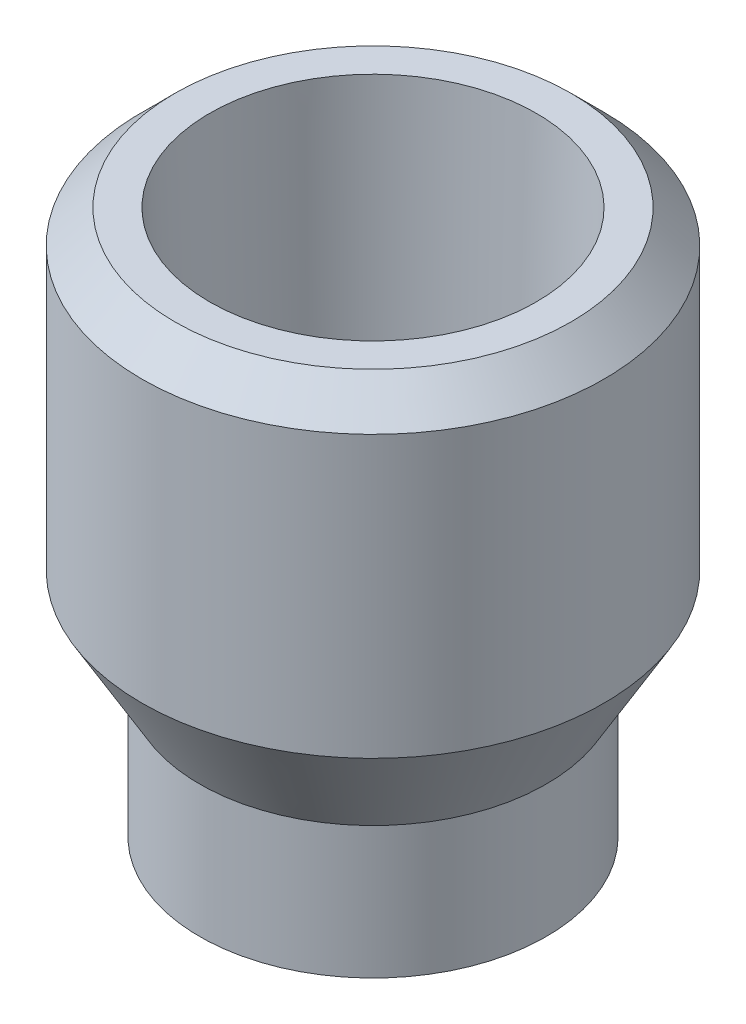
ISO-10303-21;
HEADER;
FILE_DESCRIPTION(('STEP AP214'),'2;1');
FILE_NAME('part.step','',(''),(''),'','','');
FILE_SCHEMA(('AUTOMOTIVE_DESIGN { 1 0 10303 214 1 1 1 1 }'));
ENDSEC;
DATA;
#1=APPLICATION_CONTEXT('core data for automotive mechanical design processes');
#2=APPLICATION_PROTOCOL_DEFINITION('international standard','automotive_design',2000,#1);
#3=PRODUCT_CONTEXT('',#1,'mechanical');
#4=PRODUCT('Part','Part','',(#3));
#5=PRODUCT_RELATED_PRODUCT_CATEGORY('part','',(#4));
#6=PRODUCT_DEFINITION_FORMATION('','',#4);
#7=PRODUCT_DEFINITION_CONTEXT('part definition',#1,'design');
#8=PRODUCT_DEFINITION('design','',#6,#7);
#9=PRODUCT_DEFINITION_SHAPE('','',#8);
#10=(LENGTH_UNIT() NAMED_UNIT(*) SI_UNIT(.MILLI.,.METRE.));
#11=(NAMED_UNIT(*) PLANE_ANGLE_UNIT() SI_UNIT($,.RADIAN.));
#12=(NAMED_UNIT(*) SI_UNIT($,.STERADIAN.) SOLID_ANGLE_UNIT());
#13=UNCERTAINTY_MEASURE_WITH_UNIT(LENGTH_MEASURE(1.E-05),#10,'distance_accuracy_value','');
#14=(GEOMETRIC_REPRESENTATION_CONTEXT(3) GLOBAL_UNCERTAINTY_ASSIGNED_CONTEXT((#13)) GLOBAL_UNIT_ASSIGNED_CONTEXT((#10,
#11,#12)) REPRESENTATION_CONTEXT('',''));
#15=CARTESIAN_POINT('',(0.,0.,0.));
#16=DIRECTION('',(0.,0.,1.));
#17=DIRECTION('',(1.,0.,0.));
#18=AXIS2_PLACEMENT_3D('',#15,#16,#17);
#19=CARTESIAN_POINT('',(0.,33.,0.));
#20=DIRECTION('',(0.,-1.,0.));
#21=DIRECTION('',(0.,0.,-1.));
#22=AXIS2_PLACEMENT_3D('',#19,#20,#21);
#23=CYLINDRICAL_SURFACE('',#22,14.);
#24=CARTESIAN_POINT('',(0.,31.,0.));
#25=DIRECTION('',(0.,1.,0.));
#26=DIRECTION('',(0.,0.,1.));
#27=AXIS2_PLACEMENT_3D('',#24,#25,#26);
#28=CIRCLE('',#27,14.);
#29=CARTESIAN_POINT('',(0.,31.,14.));
#30=VERTEX_POINT('',#29);
#31=EDGE_CURVE('E11',#30,#30,#28,.F.);
#32=ORIENTED_EDGE('',*,*,#31,.T.);
#33=EDGE_LOOP('',(#32));
#34=FACE_BOUND('',#33,.T.);
#35=CARTESIAN_POINT('',(0.,14.,0.));
#36=DIRECTION('',(0.,-1.,0.));
#37=DIRECTION('',(0.,0.,-1.));
#38=AXIS2_PLACEMENT_3D('',#35,#36,#37);
#39=CIRCLE('',#38,14.);
#40=CARTESIAN_POINT('',(0.,14.,-14.));
#41=VERTEX_POINT('',#40);
#42=EDGE_CURVE('E51',#41,#41,#39,.T.);
#43=ORIENTED_EDGE('',*,*,#42,.F.);
#44=EDGE_LOOP('',(#43));
#45=FACE_BOUND('',#44,.T.);
#46=ADVANCED_FACE('F34',(#34,#45),#23,.T.);
#47=CARTESIAN_POINT('',(0.,33.,0.));
#48=DIRECTION('',(0.,1.,0.));
#49=DIRECTION('',(0.,0.,1.));
#50=AXIS2_PLACEMENT_3D('',#47,#48,#49);
#51=PLANE('',#50);
#52=CARTESIAN_POINT('',(0.,33.,0.));
#53=DIRECTION('',(0.,1.,0.));
#54=DIRECTION('',(0.,0.,1.));
#55=AXIS2_PLACEMENT_3D('',#52,#53,#54);
#56=CIRCLE('',#55,9.8989007);
#57=CARTESIAN_POINT('',(0.,33.,9.8989007));
#58=VERTEX_POINT('',#57);
#59=EDGE_CURVE('E66',#58,#58,#56,.T.);
#60=ORIENTED_EDGE('',*,*,#59,.F.);
#61=EDGE_LOOP('',(#60));
#62=FACE_BOUND('',#61,.T.);
#63=CARTESIAN_POINT('',(0.,33.,0.));
#64=DIRECTION('',(0.,1.,0.));
#65=DIRECTION('',(0.,0.,1.));
#66=AXIS2_PLACEMENT_3D('',#63,#64,#65);
#67=CIRCLE('',#66,12.);
#68=CARTESIAN_POINT('',(0.,33.,12.));
#69=VERTEX_POINT('',#68);
#70=EDGE_CURVE('E42',#69,#69,#67,.T.);
#71=ORIENTED_EDGE('',*,*,#70,.T.);
#72=EDGE_LOOP('',(#71));
#73=FACE_BOUND('',#72,.T.);
#74=ADVANCED_FACE('F90',(#62,#73),#51,.T.);
#75=CARTESIAN_POINT('',(0.,14.,0.));
#76=DIRECTION('',(0.,-1.,0.));
#77=DIRECTION('',(0.,0.,-1.));
#78=AXIS2_PLACEMENT_3D('',#75,#76,#77);
#79=CYLINDRICAL_SURFACE('',#78,10.5);
#80=CARTESIAN_POINT('',(0.,8.00000000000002,0.));
#81=DIRECTION('',(0.,-1.,0.));
#82=DIRECTION('',(0.,0.,-1.));
#83=AXIS2_PLACEMENT_3D('',#80,#81,#82);
#84=CIRCLE('',#83,10.5);
#85=CARTESIAN_POINT('',(0.,8.00000000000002,-10.5));
#86=VERTEX_POINT('',#85);
#87=EDGE_CURVE('E46',#86,#86,#84,.T.);
#88=ORIENTED_EDGE('',*,*,#87,.T.);
#89=EDGE_LOOP('',(#88));
#90=FACE_BOUND('',#89,.T.);
#91=CARTESIAN_POINT('',(0.,0.,0.));
#92=DIRECTION('',(0.,-1.,0.));
#93=DIRECTION('',(0.,0.,-1.));
#94=AXIS2_PLACEMENT_3D('',#91,#92,#93);
#95=CIRCLE('',#94,10.5);
#96=CARTESIAN_POINT('',(0.,0.,-10.5));
#97=VERTEX_POINT('',#96);
#98=EDGE_CURVE('E54',#97,#97,#95,.T.);
#99=ORIENTED_EDGE('',*,*,#98,.F.);
#100=EDGE_LOOP('',(#99));
#101=FACE_BOUND('',#100,.T.);
#102=ADVANCED_FACE('F95',(#90,#101),#79,.T.);
#103=CARTESIAN_POINT('',(0.,0.,0.));
#104=DIRECTION('',(0.,1.,0.));
#105=DIRECTION('',(0.,0.,1.));
#106=AXIS2_PLACEMENT_3D('',#103,#104,#105);
#107=PLANE('',#106);
#108=CARTESIAN_POINT('',(0.,0.,0.));
#109=DIRECTION('',(0.,-1.,0.));
#110=DIRECTION('',(0.,0.,-1.));
#111=AXIS2_PLACEMENT_3D('',#108,#109,#110);
#112=CIRCLE('',#111,3.5);
#113=CARTESIAN_POINT('',(0.,0.,-3.5));
#114=VERTEX_POINT('',#113);
#115=EDGE_CURVE('E69',#114,#114,#112,.T.);
#116=ORIENTED_EDGE('',*,*,#115,.F.);
#117=EDGE_LOOP('',(#116));
#118=FACE_BOUND('',#117,.T.);
#119=ORIENTED_EDGE('',*,*,#98,.T.);
#120=EDGE_LOOP('',(#119));
#121=FACE_BOUND('',#120,.T.);
#122=ADVANCED_FACE('F100',(#118,#121),#107,.F.);
#123=CARTESIAN_POINT('',(0.,8.00000000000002,0.));
#124=DIRECTION('',(0.,1.,0.));
#125=DIRECTION('',(0.,0.,1.));
#126=AXIS2_PLACEMENT_3D('',#123,#124,#125);
#127=CONICAL_SURFACE('',#126,10.5,0.528074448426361);
#128=ORIENTED_EDGE('',*,*,#42,.T.);
#129=EDGE_LOOP('',(#128));
#130=FACE_BOUND('',#129,.T.);
#131=ORIENTED_EDGE('',*,*,#87,.F.);
#132=EDGE_LOOP('',(#131));
#133=FACE_BOUND('',#132,.T.);
#134=ADVANCED_FACE('F101',(#130,#133),#127,.T.);
#135=CARTESIAN_POINT('',(0.,33.,0.));
#136=DIRECTION('',(0.,-1.,0.));
#137=DIRECTION('',(0.,0.,-1.));
#138=AXIS2_PLACEMENT_3D('',#135,#136,#137);
#139=CONICAL_SURFACE('',#138,12.,0.785398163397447);
#140=ORIENTED_EDGE('',*,*,#31,.F.);
#141=EDGE_LOOP('',(#140));
#142=FACE_BOUND('',#141,.T.);
#143=ORIENTED_EDGE('',*,*,#70,.F.);
#144=EDGE_LOOP('',(#143));
#145=FACE_BOUND('',#144,.T.);
#146=ADVANCED_FACE('F36',(#142,#145),#139,.T.);
#147=CARTESIAN_POINT('',(0.,13.5,0.));
#148=DIRECTION('',(0.,1.,0.));
#149=DIRECTION('',(0.,0.,1.));
#150=AXIS2_PLACEMENT_3D('',#147,#148,#149);
#151=CONICAL_SURFACE('',#150,8.9281,1.0471975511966);
#152=CARTESIAN_POINT('',(0.,10.3660850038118,0.));
#153=DIRECTION('',(0.,1.,0.));
#154=DIRECTION('',(0.,0.,1.));
#155=AXIS2_PLACEMENT_3D('',#152,#153,#154);
#156=CIRCLE('',#155,3.5);
#157=CARTESIAN_POINT('',(0.,10.3660850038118,3.5));
#158=VERTEX_POINT('',#157);
#159=EDGE_CURVE('E38',#158,#158,#156,.F.);
#160=ORIENTED_EDGE('',*,*,#159,.T.);
#161=EDGE_LOOP('',(#160));
#162=FACE_BOUND('',#161,.T.);
#163=CARTESIAN_POINT('',(0.,13.5,0.));
#164=DIRECTION('',(0.,1.,0.));
#165=DIRECTION('',(0.,0.,1.));
#166=AXIS2_PLACEMENT_3D('',#163,#164,#165);
#167=CIRCLE('',#166,8.9281);
#168=CARTESIAN_POINT('',(0.,13.5,8.9281));
#169=VERTEX_POINT('',#168);
#170=EDGE_CURVE('E57',#169,#169,#167,.T.);
#171=ORIENTED_EDGE('',*,*,#170,.T.);
#172=EDGE_LOOP('',(#171));
#173=FACE_BOUND('',#172,.T.);
#174=ADVANCED_FACE('F76',(#162,#173),#151,.F.);
#175=CARTESIAN_POINT('',(0.,33.,0.));
#176=DIRECTION('',(0.,1.,0.));
#177=DIRECTION('',(0.,0.,1.));
#178=AXIS2_PLACEMENT_3D('',#175,#176,#177);
#179=CYLINDRICAL_SURFACE('',#178,8.9281);
#180=ORIENTED_EDGE('',*,*,#170,.F.);
#181=EDGE_LOOP('',(#180));
#182=FACE_BOUND('',#181,.T.);
#183=CARTESIAN_POINT('',(0.,19.,0.));
#184=DIRECTION('',(0.,1.,0.));
#185=DIRECTION('',(0.,0.,1.));
#186=AXIS2_PLACEMENT_3D('',#183,#184,#185);
#187=CIRCLE('',#186,8.9281);
#188=CARTESIAN_POINT('',(0.,19.,8.9281));
#189=VERTEX_POINT('',#188);
#190=EDGE_CURVE('E60',#189,#189,#187,.T.);
#191=ORIENTED_EDGE('',*,*,#190,.T.);
#192=EDGE_LOOP('',(#191));
#193=FACE_BOUND('',#192,.T.);
#194=ADVANCED_FACE('F124',(#182,#193),#179,.F.);
#195=CARTESIAN_POINT('',(8.9281,19.,0.));
#196=DIRECTION('',(0.,-1.,0.));
#197=DIRECTION('',(0.,0.,-1.));
#198=AXIS2_PLACEMENT_3D('',#195,#196,#197);
#199=PLANE('',#198);
#200=ORIENTED_EDGE('',*,*,#190,.F.);
#201=EDGE_LOOP('',(#200));
#202=FACE_BOUND('',#201,.T.);
#203=CARTESIAN_POINT('',(0.,19.,0.));
#204=DIRECTION('',(0.,1.,0.));
#205=DIRECTION('',(0.,0.,1.));
#206=AXIS2_PLACEMENT_3D('',#203,#204,#205);
#207=CIRCLE('',#206,9.47972195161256);
#208=CARTESIAN_POINT('',(0.,19.,9.47972195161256));
#209=VERTEX_POINT('',#208);
#210=EDGE_CURVE('E63',#209,#209,#207,.T.);
#211=ORIENTED_EDGE('',*,*,#210,.T.);
#212=EDGE_LOOP('',(#211));
#213=FACE_BOUND('',#212,.T.);
#214=ADVANCED_FACE('F86',(#202,#213),#199,.F.);
#215=CARTESIAN_POINT('',(0.,33.,0.));
#216=DIRECTION('',(0.,1.,0.));
#217=DIRECTION('',(0.,0.,1.));
#218=AXIS2_PLACEMENT_3D('',#215,#216,#217);
#219=CONICAL_SURFACE('',#218,9.8989007,0.0299323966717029);
#220=ORIENTED_EDGE('',*,*,#210,.F.);
#221=EDGE_LOOP('',(#220));
#222=FACE_BOUND('',#221,.T.);
#223=ORIENTED_EDGE('',*,*,#59,.T.);
#224=EDGE_LOOP('',(#223));
#225=FACE_BOUND('',#224,.T.);
#226=ADVANCED_FACE('F81',(#222,#225),#219,.F.);
#227=CARTESIAN_POINT('',(0.,33.,0.));
#228=DIRECTION('',(0.,-1.,0.));
#229=DIRECTION('',(0.,0.,-1.));
#230=AXIS2_PLACEMENT_3D('',#227,#228,#229);
#231=CYLINDRICAL_SURFACE('',#230,3.5);
#232=ORIENTED_EDGE('',*,*,#115,.T.);
#233=EDGE_LOOP('',(#232));
#234=FACE_BOUND('',#233,.T.);
#235=ORIENTED_EDGE('',*,*,#159,.F.);
#236=EDGE_LOOP('',(#235));
#237=FACE_BOUND('',#236,.T.);
#238=ADVANCED_FACE('F79',(#234,#237),#231,.F.);
#239=CLOSED_SHELL('',(#46,#74,#102,#122,#134,#146,#174,#194,#214,#226,#238));
#240=MANIFOLD_SOLID_BREP('B2',#239);
#241=ADVANCED_BREP_SHAPE_REPRESENTATION('',(#18,#240),#14);
#242=SHAPE_DEFINITION_REPRESENTATION(#9,#241);
ENDSEC;
END-ISO-10303-21;
